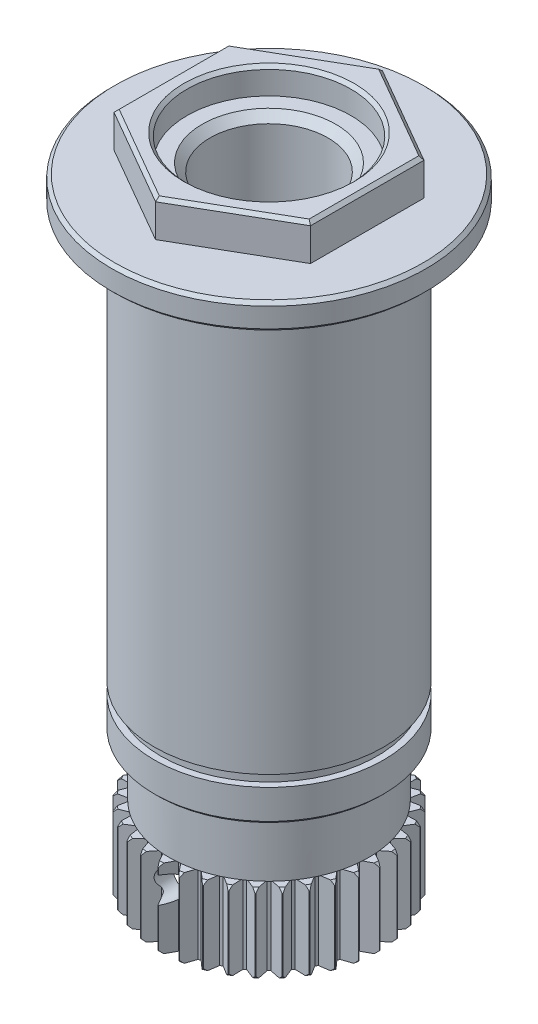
from build123d import *

# Parameters (mm, degrees)
EXTRUSION2_START             = -5.5
ESQUISSE7_R                  = 12.5
EXTRUSION2_DEPTH             = 5.5
ESQUISSE10_R                 = 2
ENL_V_MAT_EXTRU_12_DEPTH     = 21.5
CHANFREIN1_SIZE              = 0.5
ENL_V_MAT_EXTRU_13_DEPTH     = 12
R_P_TITION_CIRCULAIRE2_COUNT = 36
CHANFREIN2_SIZE              = 1.2
CHANFREIN3_SIZE              = 0.5
ESQUISSE11_W                 = 10.4
ESQUISSE11_H                 = 2.9
CONG_1_R                     = 0.1
CONG_2_R                     = 0.13
R_P_TITION_LIN_AIRE1_COUNT   = 2
R_P_TITION_LIN_AIRE1_PITCH   = 44.3


with BuildPart() as part:
    # Esquisse1 → R_volution1 (revolve)
    with BuildSketch(Plane.XY, mode=Mode.PRIVATE) as r_volution1_sk:
        Polygon((-12.5, 9.5), (-12.5, 5.5), (-9, 5.5), (-9, -6.5), (-8.1, -6.5), (-8.1, -60), (-9, -60), (-9, -74.7), (-12.85, -74.7), (-12.85, -90.7), (-16.9, -90.7), (-16.9, -78.7), (-15.25, -78.7), (-15.25, -69.7), (-17.5, -69.7), (-17.5, -64.7), (-16.5, -64.7), (-16.5, -63), (-17.5, -63), (-17.5, 0), (-24, 0), (-24, 4), (-15, 4), (-15, 9.5), align=None)
    revolve(r_volution1_sk.sketch.rotate(Axis((0, 102.838169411, 0), (0, -1, 0)), 270), axis=Axis((0, 102.838169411, 0), (0, -1, 0)))

    # Esquisse7 → Extrusion2 (add)
    with BuildSketch(Plane(origin=(0, 9.5, 0), x_dir=(-1, 0, 0), z_dir=(0, 1, 0)).offset(EXTRUSION2_START)):
        Polygon((15, -8.660254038), (15, 8.660254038), (0, 17.320508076), (-15, 8.660254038), (-15, -8.660254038), (0, -17.320508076), align=None)
        with Locations(Location((0, 0, 0), (0, 0, 90))):
            Circle(ESQUISSE7_R, mode=Mode.SUBTRACT)
    extrude(amount=EXTRUSION2_DEPTH)

    # Esquisse10 → Enl_v. mat.-Extru.12 (cut, symmetric)
    with BuildSketch(Plane.XY):
        with Locations((0, -82.2)):
            Circle(ESQUISSE10_R)
    extrude(amount=ENL_V_MAT_EXTRU_12_DEPTH, both=True, mode=Mode.SUBTRACT)

    # Chanfrein1
    chanfrein1_edges = [part.edges().sort_by_distance(p)[0] for p in [
        (0, 9.5, -12.5),
        (0, -6.5, -8.1),
        (0, -60, -8.1),
        (0, -90.7, -16.9),
        (0, -78.7, -16.9),
        (0, -69.7, -17.5),
        (0, 0, -24),
        (0, 4, -24),
    ]]
    chamfer(chanfrein1_edges, length=CHANFREIN1_SIZE)

    # Esquisse12 → Enl_v. mat.-Extru.13 (cut)
    with BuildSketch(Plane.XZ.offset(90.7)):
        with BuildLine():
            Line((-1.307336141, 14.942920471), (-1.531051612, 17.5))
            Line((-1.531051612, 17.5), (1.531051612, 17.5))
            Line((1.531051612, 17.5), (1.307336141, 14.942920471))
            ThreePointArc((1.307336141, 14.942920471), (1.207538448, 14.951316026), (1.107686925, 14.959045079))
            Line((1.107686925, 14.959045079), (0, 17))
            Line((0, 17), (-1.107686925, 14.959045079))
            ThreePointArc((-1.107686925, 14.959045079), (-1.207538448, 14.951316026), (-1.307336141, 14.942920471))
        make_face()
    enl_v_mat_extru_13 = extrude(amount=-ENL_V_MAT_EXTRU_13_DEPTH, mode=Mode.SUBTRACT)

    # R_p_tition circulaire2: Enl_v. mat.-Extru.13 ×36 about axis
    r_p_tition_circulaire2_axis = Axis((0, 0, 0), (0, 1, 0))
    for i in range(1, R_P_TITION_CIRCULAIRE2_COUNT):
        add(enl_v_mat_extru_13.rotate(r_p_tition_circulaire2_axis, i * 360 / R_P_TITION_CIRCULAIRE2_COUNT), mode=Mode.SUBTRACT)

    # Chanfrein2
    chanfrein2_edges = [part.edges().sort_by_distance(p)[0] for p in [
        (0, 5.5, -9),
        (0, -74.7, -9),
    ]]
    chamfer(chanfrein2_edges, length=CHANFREIN2_SIZE)

    # Chanfrein3
    chanfrein3_edges = [part.edges().sort_by_distance(p)[0] for p in [
        (-7.5, 9.5, -12.990381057),
        (-15, 9.5, 0),
        (-7.5, 9.5, 12.990381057),
        (7.5, 9.5, 12.990381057),
        (15, 9.5, 0),
        (7.5, 9.5, -12.990381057),
    ]]
    chamfer(chanfrein3_edges, length=CHANFREIN3_SIZE)

    # Esquisse11 → Enl_vement de mati_re-R_volution1 (revolve, cut)
    with BuildSketch(Plane.XY, mode=Mode.PRIVATE) as enl_vement_de_mati_re_r_volution1_sk:
        with Locations((-5.2, -10.95)):
            Rectangle(ESQUISSE11_W, ESQUISSE11_H)
    enl_vement_de_mati_re_r_volution1 = revolve(enl_vement_de_mati_re_r_volution1_sk.sketch.rotate(Axis((0, 102.838169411, 0), (0, -1, 0)), 90), axis=Axis((0, 102.838169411, 0), (0, -1, 0)), mode=Mode.SUBTRACT)

    # Cong_1
    cong_1_edges = [part.edges().sort_by_distance(p)[0] for p in [
        (0, -12.4, -8.1),
        (0, -9.5, -8.1),
    ]]
    fillet(cong_1_edges, radius=CONG_1_R)

    # Cong_2
    cong_2_edges = [part.edges().sort_by_distance(p)[0] for p in [
        (0, -12.4, 10.4),
        (0, -9.5, 10.4),
    ]]
    fillet(cong_2_edges, radius=CONG_2_R)

    # R_p_tition lin_aire1: Enl_vement de mati_re-R_volution1 ×2
    with Locations(*[(0, -i * R_P_TITION_LIN_AIRE1_PITCH, 0) for i in range(1, R_P_TITION_LIN_AIRE1_COUNT)]):
        add(enl_vement_de_mati_re_r_volution1, mode=Mode.SUBTRACT)


solid = part.part
